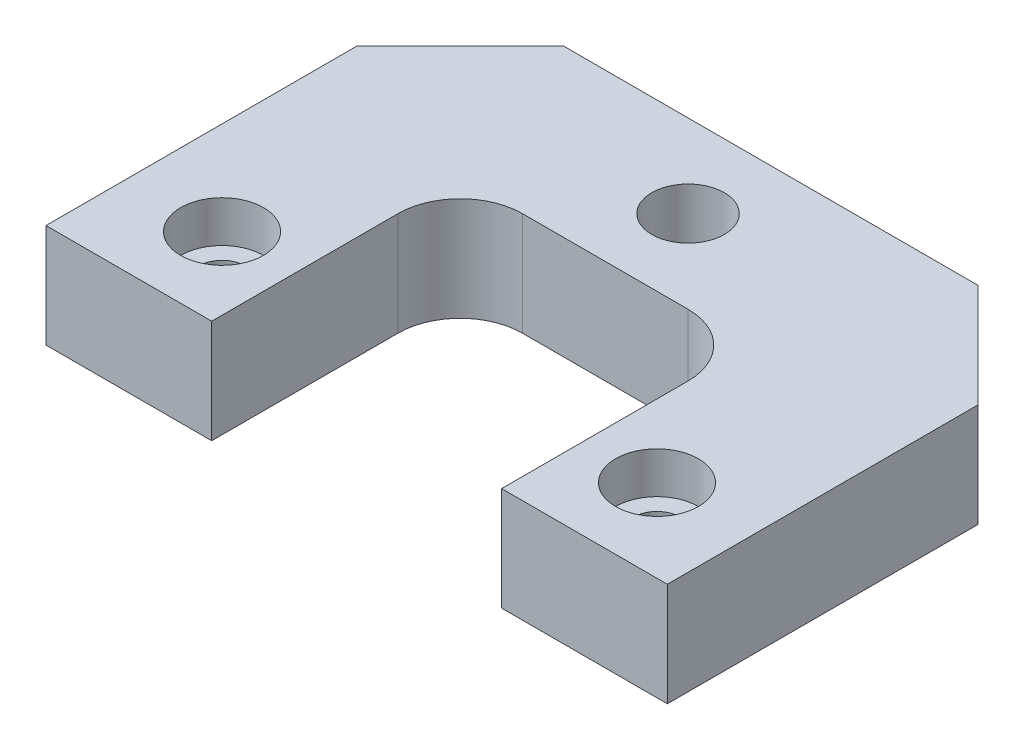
ISO-10303-21;
HEADER;
FILE_DESCRIPTION(('STEP AP214'),'2;1');
FILE_NAME('part.step','',(''),(''),'','','');
FILE_SCHEMA(('AUTOMOTIVE_DESIGN { 1 0 10303 214 1 1 1 1 }'));
ENDSEC;
DATA;
#1=APPLICATION_CONTEXT('core data for automotive mechanical design processes');
#2=APPLICATION_PROTOCOL_DEFINITION('international standard','automotive_design',2000,#1);
#3=PRODUCT_CONTEXT('',#1,'mechanical');
#4=PRODUCT('Part','Part','',(#3));
#5=PRODUCT_RELATED_PRODUCT_CATEGORY('part','',(#4));
#6=PRODUCT_DEFINITION_FORMATION('','',#4);
#7=PRODUCT_DEFINITION_CONTEXT('part definition',#1,'design');
#8=PRODUCT_DEFINITION('design','',#6,#7);
#9=PRODUCT_DEFINITION_SHAPE('','',#8);
#10=(LENGTH_UNIT() NAMED_UNIT(*) SI_UNIT(.MILLI.,.METRE.));
#11=(NAMED_UNIT(*) PLANE_ANGLE_UNIT() SI_UNIT($,.RADIAN.));
#12=(NAMED_UNIT(*) SI_UNIT($,.STERADIAN.) SOLID_ANGLE_UNIT());
#13=UNCERTAINTY_MEASURE_WITH_UNIT(LENGTH_MEASURE(1.E-05),#10,'distance_accuracy_value','');
#14=(GEOMETRIC_REPRESENTATION_CONTEXT(3) GLOBAL_UNCERTAINTY_ASSIGNED_CONTEXT((#13)) GLOBAL_UNIT_ASSIGNED_CONTEXT((#10,
#11,#12)) REPRESENTATION_CONTEXT('',''));
#15=CARTESIAN_POINT('',(0.,0.,0.));
#16=DIRECTION('',(0.,0.,1.));
#17=DIRECTION('',(1.,0.,0.));
#18=AXIS2_PLACEMENT_3D('',#15,#16,#17);
#19=CARTESIAN_POINT('',(21.,6.,12.));
#20=DIRECTION('',(0.,1.,0.));
#21=DIRECTION('',(0.,0.,1.));
#22=AXIS2_PLACEMENT_3D('',#19,#20,#21);
#23=CYLINDRICAL_SURFACE('',#22,4.);
#24=CARTESIAN_POINT('',(21.,10.,12.));
#25=DIRECTION('',(0.,1.,0.));
#26=DIRECTION('',(0.,0.,1.));
#27=AXIS2_PLACEMENT_3D('',#24,#25,#26);
#28=CIRCLE('',#27,4.);
#29=CARTESIAN_POINT('',(21.,10.,16.));
#30=VERTEX_POINT('',#29);
#31=EDGE_CURVE('E232',#30,#30,#28,.F.);
#32=ORIENTED_EDGE('',*,*,#31,.F.);
#33=EDGE_LOOP('',(#32));
#34=FACE_BOUND('',#33,.T.);
#35=CARTESIAN_POINT('',(21.,6.,12.));
#36=DIRECTION('',(0.,1.,0.));
#37=DIRECTION('',(0.,0.,1.));
#38=AXIS2_PLACEMENT_3D('',#35,#36,#37);
#39=CIRCLE('',#38,4.);
#40=CARTESIAN_POINT('',(21.,6.,16.));
#41=VERTEX_POINT('',#40);
#42=EDGE_CURVE('E20',#41,#41,#39,.T.);
#43=ORIENTED_EDGE('',*,*,#42,.F.);
#44=EDGE_LOOP('',(#43));
#45=FACE_BOUND('',#44,.T.);
#46=ADVANCED_FACE('F17',(#34,#45),#23,.F.);
#47=CARTESIAN_POINT('',(-21.,6.,12.));
#48=DIRECTION('',(0.,1.,0.));
#49=DIRECTION('',(0.,0.,1.));
#50=AXIS2_PLACEMENT_3D('',#47,#48,#49);
#51=CYLINDRICAL_SURFACE('',#50,4.);
#52=CARTESIAN_POINT('',(-21.,10.,12.));
#53=DIRECTION('',(0.,1.,0.));
#54=DIRECTION('',(0.,0.,1.));
#55=AXIS2_PLACEMENT_3D('',#52,#53,#54);
#56=CIRCLE('',#55,4.);
#57=CARTESIAN_POINT('',(-21.,10.,16.));
#58=VERTEX_POINT('',#57);
#59=EDGE_CURVE('E229',#58,#58,#56,.F.);
#60=ORIENTED_EDGE('',*,*,#59,.F.);
#61=EDGE_LOOP('',(#60));
#62=FACE_BOUND('',#61,.T.);
#63=CARTESIAN_POINT('',(-21.,6.,12.));
#64=DIRECTION('',(0.,1.,0.));
#65=DIRECTION('',(0.,0.,1.));
#66=AXIS2_PLACEMENT_3D('',#63,#64,#65);
#67=CIRCLE('',#66,4.);
#68=CARTESIAN_POINT('',(-21.,6.,16.));
#69=VERTEX_POINT('',#68);
#70=EDGE_CURVE('E234',#69,#69,#67,.T.);
#71=ORIENTED_EDGE('',*,*,#70,.F.);
#72=EDGE_LOOP('',(#71));
#73=FACE_BOUND('',#72,.T.);
#74=ADVANCED_FACE('F244',(#62,#73),#51,.F.);
#75=CARTESIAN_POINT('',(21.,6.,12.));
#76=DIRECTION('',(0.,1.,0.));
#77=DIRECTION('',(0.,0.,1.));
#78=AXIS2_PLACEMENT_3D('',#75,#76,#77);
#79=PLANE('',#78);
#80=CARTESIAN_POINT('',(21.,6.,12.));
#81=DIRECTION('',(0.,1.,0.));
#82=DIRECTION('',(0.,0.,1.));
#83=AXIS2_PLACEMENT_3D('',#80,#81,#82);
#84=CIRCLE('',#83,2.25);
#85=CARTESIAN_POINT('',(21.,6.,14.25));
#86=VERTEX_POINT('',#85);
#87=EDGE_CURVE('E223',#86,#86,#84,.F.);
#88=ORIENTED_EDGE('',*,*,#87,.T.);
#89=EDGE_LOOP('',(#88));
#90=FACE_BOUND('',#89,.T.);
#91=ORIENTED_EDGE('',*,*,#42,.T.);
#92=EDGE_LOOP('',(#91));
#93=FACE_BOUND('',#92,.T.);
#94=ADVANCED_FACE('F241',(#90,#93),#79,.T.);
#95=CARTESIAN_POINT('',(-21.,6.,12.));
#96=DIRECTION('',(0.,1.,0.));
#97=DIRECTION('',(0.,0.,1.));
#98=AXIS2_PLACEMENT_3D('',#95,#96,#97);
#99=PLANE('',#98);
#100=CARTESIAN_POINT('',(-21.,6.,12.));
#101=DIRECTION('',(0.,1.,0.));
#102=DIRECTION('',(0.,0.,1.));
#103=AXIS2_PLACEMENT_3D('',#100,#101,#102);
#104=CIRCLE('',#103,2.25);
#105=CARTESIAN_POINT('',(-21.,6.,14.25));
#106=VERTEX_POINT('',#105);
#107=EDGE_CURVE('E177',#106,#106,#104,.F.);
#108=ORIENTED_EDGE('',*,*,#107,.T.);
#109=EDGE_LOOP('',(#108));
#110=FACE_BOUND('',#109,.T.);
#111=ORIENTED_EDGE('',*,*,#70,.T.);
#112=EDGE_LOOP('',(#111));
#113=FACE_BOUND('',#112,.T.);
#114=ADVANCED_FACE('F318',(#110,#113),#99,.T.);
#115=CARTESIAN_POINT('',(0.,10.,0.));
#116=DIRECTION('',(0.,1.,0.));
#117=DIRECTION('',(0.,0.,1.));
#118=AXIS2_PLACEMENT_3D('',#115,#116,#117);
#119=PLANE('',#118);
#120=DIRECTION('',(0.,0.,-1.));
#121=VECTOR('',#120,1.);
#122=CARTESIAN_POINT('',(14.,10.,44.));
#123=LINE('',#122,#121);
#124=CARTESIAN_POINT('',(14.,10.,2.00000000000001));
#125=VERTEX_POINT('',#124);
#126=CARTESIAN_POINT('',(14.,10.,20.));
#127=VERTEX_POINT('',#126);
#128=EDGE_CURVE('E186',#125,#127,#123,.F.);
#129=ORIENTED_EDGE('',*,*,#128,.T.);
#130=DIRECTION('',(-1.,0.,0.));
#131=VECTOR('',#130,1.);
#132=CARTESIAN_POINT('',(-30.,10.,20.));
#133=LINE('',#132,#131);
#134=CARTESIAN_POINT('',(30.,10.,20.));
#135=VERTEX_POINT('',#134);
#136=EDGE_CURVE('E192',#127,#135,#133,.F.);
#137=ORIENTED_EDGE('',*,*,#136,.T.);
#138=DIRECTION('',(0.,0.,1.));
#139=VECTOR('',#138,1.);
#140=CARTESIAN_POINT('',(30.,10.,-20.));
#141=LINE('',#140,#139);
#142=CARTESIAN_POINT('',(30.,10.,-9.99999999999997));
#143=VERTEX_POINT('',#142);
#144=EDGE_CURVE('E519',#135,#143,#141,.F.);
#145=ORIENTED_EDGE('',*,*,#144,.T.);
#146=DIRECTION('',(0.707106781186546,0.,0.707106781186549));
#147=VECTOR('',#146,1.);
#148=CARTESIAN_POINT('',(20.,10.,-20.));
#149=LINE('',#148,#147);
#150=CARTESIAN_POINT('',(20.,10.,-20.));
#151=VERTEX_POINT('',#150);
#152=EDGE_CURVE('E171',#143,#151,#149,.F.);
#153=ORIENTED_EDGE('',*,*,#152,.T.);
#154=DIRECTION('',(1.,0.,0.));
#155=VECTOR('',#154,1.);
#156=CARTESIAN_POINT('',(-30.,10.,-20.));
#157=LINE('',#156,#155);
#158=CARTESIAN_POINT('',(-19.9999999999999,10.,-20.));
#159=VERTEX_POINT('',#158);
#160=EDGE_CURVE('E180',#151,#159,#157,.F.);
#161=ORIENTED_EDGE('',*,*,#160,.T.);
#162=DIRECTION('',(0.707106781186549,0.,-0.707106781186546));
#163=VECTOR('',#162,1.);
#164=CARTESIAN_POINT('',(-30.,10.,-9.99999999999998));
#165=LINE('',#164,#163);
#166=CARTESIAN_POINT('',(-30.,10.,-9.99999999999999));
#167=VERTEX_POINT('',#166);
#168=EDGE_CURVE('E160',#159,#167,#165,.F.);
#169=ORIENTED_EDGE('',*,*,#168,.T.);
#170=DIRECTION('',(0.,0.,-1.));
#171=VECTOR('',#170,1.);
#172=CARTESIAN_POINT('',(-30.,10.,-20.));
#173=LINE('',#172,#171);
#174=CARTESIAN_POINT('',(-30.,10.,20.));
#175=VERTEX_POINT('',#174);
#176=EDGE_CURVE('E149',#167,#175,#173,.F.);
#177=ORIENTED_EDGE('',*,*,#176,.T.);
#178=DIRECTION('',(-1.,0.,0.));
#179=VECTOR('',#178,1.);
#180=CARTESIAN_POINT('',(-30.,10.,20.));
#181=LINE('',#180,#179);
#182=CARTESIAN_POINT('',(-14.,10.,20.));
#183=VERTEX_POINT('',#182);
#184=EDGE_CURVE('E136',#175,#183,#181,.F.);
#185=ORIENTED_EDGE('',*,*,#184,.T.);
#186=DIRECTION('',(0.,0.,1.));
#187=VECTOR('',#186,1.);
#188=CARTESIAN_POINT('',(-14.,10.,44.));
#189=LINE('',#188,#187);
#190=CARTESIAN_POINT('',(-14.,10.,2.00000000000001));
#191=VERTEX_POINT('',#190);
#192=EDGE_CURVE('E103',#183,#191,#189,.F.);
#193=ORIENTED_EDGE('',*,*,#192,.T.);
#194=CARTESIAN_POINT('',(-8.,10.,2.00000000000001));
#195=DIRECTION('',(0.,-1.,0.));
#196=DIRECTION('',(0.,0.,-1.));
#197=AXIS2_PLACEMENT_3D('',#194,#195,#196);
#198=CIRCLE('',#197,6.);
#199=CARTESIAN_POINT('',(-8.,10.,-3.99999999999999));
#200=VERTEX_POINT('',#199);
#201=EDGE_CURVE('E105',#191,#200,#198,.T.);
#202=ORIENTED_EDGE('',*,*,#201,.T.);
#203=DIRECTION('',(-1.,0.,0.));
#204=VECTOR('',#203,1.);
#205=CARTESIAN_POINT('',(-14.,10.,-3.99999999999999));
#206=LINE('',#205,#204);
#207=CARTESIAN_POINT('',(8.,10.,-3.99999999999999));
#208=VERTEX_POINT('',#207);
#209=EDGE_CURVE('E109',#200,#208,#206,.F.);
#210=ORIENTED_EDGE('',*,*,#209,.T.);
#211=CARTESIAN_POINT('',(8.,10.,2.00000000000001));
#212=DIRECTION('',(0.,-1.,0.));
#213=DIRECTION('',(0.,0.,-1.));
#214=AXIS2_PLACEMENT_3D('',#211,#212,#213);
#215=CIRCLE('',#214,6.);
#216=EDGE_CURVE('E219',#208,#125,#215,.T.);
#217=ORIENTED_EDGE('',*,*,#216,.T.);
#218=EDGE_LOOP('',(#129,#137,#145,#153,#161,#169,#177,#185,#193,#202,#210,#217));
#219=FACE_BOUND('',#218,.T.);
#220=ORIENTED_EDGE('',*,*,#59,.T.);
#221=EDGE_LOOP('',(#220));
#222=FACE_BOUND('',#221,.T.);
#223=ORIENTED_EDGE('',*,*,#31,.T.);
#224=EDGE_LOOP('',(#223));
#225=FACE_BOUND('',#224,.T.);
#226=CARTESIAN_POINT('',(0.,10.,-12.));
#227=DIRECTION('',(0.,1.,0.));
#228=DIRECTION('',(0.,0.,1.));
#229=AXIS2_PLACEMENT_3D('',#226,#227,#228);
#230=CIRCLE('',#229,3.5);
#231=CARTESIAN_POINT('',(0.,10.,-8.49999999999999));
#232=VERTEX_POINT('',#231);
#233=EDGE_CURVE('E226',#232,#232,#230,.F.);
#234=ORIENTED_EDGE('',*,*,#233,.T.);
#235=EDGE_LOOP('',(#234));
#236=FACE_BOUND('',#235,.T.);
#237=ADVANCED_FACE('F107',(#219,#222,#225,#236),#119,.T.);
#238=CARTESIAN_POINT('',(0.,10.,-12.));
#239=DIRECTION('',(0.,1.,0.));
#240=DIRECTION('',(0.,0.,1.));
#241=AXIS2_PLACEMENT_3D('',#238,#239,#240);
#242=CYLINDRICAL_SURFACE('',#241,3.5);
#243=CARTESIAN_POINT('',(0.,0.,-12.));
#244=DIRECTION('',(0.,1.,0.));
#245=DIRECTION('',(0.,0.,1.));
#246=AXIS2_PLACEMENT_3D('',#243,#244,#245);
#247=CIRCLE('',#246,3.5);
#248=CARTESIAN_POINT('',(0.,0.,-8.49999999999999));
#249=VERTEX_POINT('',#248);
#250=EDGE_CURVE('E183',#249,#249,#247,.F.);
#251=ORIENTED_EDGE('',*,*,#250,.T.);
#252=EDGE_LOOP('',(#251));
#253=FACE_BOUND('',#252,.T.);
#254=ORIENTED_EDGE('',*,*,#233,.F.);
#255=EDGE_LOOP('',(#254));
#256=FACE_BOUND('',#255,.T.);
#257=ADVANCED_FACE('F311',(#253,#256),#242,.F.);
#258=CARTESIAN_POINT('',(21.,0.,12.));
#259=DIRECTION('',(0.,1.,0.));
#260=DIRECTION('',(0.,0.,1.));
#261=AXIS2_PLACEMENT_3D('',#258,#259,#260);
#262=CYLINDRICAL_SURFACE('',#261,2.25);
#263=CARTESIAN_POINT('',(21.,0.,12.));
#264=DIRECTION('',(0.,1.,0.));
#265=DIRECTION('',(0.,0.,1.));
#266=AXIS2_PLACEMENT_3D('',#263,#264,#265);
#267=CIRCLE('',#266,2.25);
#268=CARTESIAN_POINT('',(21.,0.,14.25));
#269=VERTEX_POINT('',#268);
#270=EDGE_CURVE('E214',#269,#269,#267,.F.);
#271=ORIENTED_EDGE('',*,*,#270,.T.);
#272=EDGE_LOOP('',(#271));
#273=FACE_BOUND('',#272,.T.);
#274=ORIENTED_EDGE('',*,*,#87,.F.);
#275=EDGE_LOOP('',(#274));
#276=FACE_BOUND('',#275,.T.);
#277=ADVANCED_FACE('F307',(#273,#276),#262,.F.);
#278=CARTESIAN_POINT('',(-21.,0.,12.));
#279=DIRECTION('',(0.,1.,0.));
#280=DIRECTION('',(0.,0.,1.));
#281=AXIS2_PLACEMENT_3D('',#278,#279,#280);
#282=CYLINDRICAL_SURFACE('',#281,2.25);
#283=CARTESIAN_POINT('',(-21.,0.,12.));
#284=DIRECTION('',(0.,1.,0.));
#285=DIRECTION('',(0.,0.,1.));
#286=AXIS2_PLACEMENT_3D('',#283,#284,#285);
#287=CIRCLE('',#286,2.25);
#288=CARTESIAN_POINT('',(-21.,0.,14.25));
#289=VERTEX_POINT('',#288);
#290=EDGE_CURVE('E165',#289,#289,#287,.F.);
#291=ORIENTED_EDGE('',*,*,#290,.T.);
#292=EDGE_LOOP('',(#291));
#293=FACE_BOUND('',#292,.T.);
#294=ORIENTED_EDGE('',*,*,#107,.F.);
#295=EDGE_LOOP('',(#294));
#296=FACE_BOUND('',#295,.T.);
#297=ADVANCED_FACE('F303',(#293,#296),#282,.F.);
#298=CARTESIAN_POINT('',(-30.,10.,-9.99999999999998));
#299=DIRECTION('',(0.707106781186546,0.,0.707106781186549));
#300=DIRECTION('',(0.707106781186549,0.,-0.707106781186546));
#301=AXIS2_PLACEMENT_3D('',#298,#299,#300);
#302=PLANE('',#301);
#303=DIRECTION('',(0.,1.,0.));
#304=VECTOR('',#303,1.);
#305=CARTESIAN_POINT('',(-19.9999999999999,10.,-20.));
#306=LINE('',#305,#304);
#307=CARTESIAN_POINT('',(-19.9999999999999,0.,-20.));
#308=VERTEX_POINT('',#307);
#309=EDGE_CURVE('E168',#159,#308,#306,.F.);
#310=ORIENTED_EDGE('',*,*,#309,.T.);
#311=DIRECTION('',(-0.707106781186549,0.,0.707106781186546));
#312=VECTOR('',#311,1.);
#313=CARTESIAN_POINT('',(-19.9999999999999,0.,-20.));
#314=LINE('',#313,#312);
#315=CARTESIAN_POINT('',(-30.,0.,-9.99999999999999));
#316=VERTEX_POINT('',#315);
#317=EDGE_CURVE('E154',#308,#316,#314,.T.);
#318=ORIENTED_EDGE('',*,*,#317,.T.);
#319=DIRECTION('',(0.,1.,0.));
#320=VECTOR('',#319,1.);
#321=CARTESIAN_POINT('',(-30.,10.,-9.99999999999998));
#322=LINE('',#321,#320);
#323=EDGE_CURVE('E157',#316,#167,#322,.T.);
#324=ORIENTED_EDGE('',*,*,#323,.T.);
#325=ORIENTED_EDGE('',*,*,#168,.F.);
#326=EDGE_LOOP('',(#310,#318,#324,#325));
#327=FACE_BOUND('',#326,.T.);
#328=ADVANCED_FACE('F299',(#327),#302,.F.);
#329=CARTESIAN_POINT('',(-30.,10.,-20.));
#330=DIRECTION('',(1.,0.,0.));
#331=DIRECTION('',(0.,0.,-1.));
#332=AXIS2_PLACEMENT_3D('',#329,#330,#331);
#333=PLANE('',#332);
#334=ORIENTED_EDGE('',*,*,#323,.F.);
#335=DIRECTION('',(0.,0.,1.));
#336=VECTOR('',#335,1.);
#337=CARTESIAN_POINT('',(-30.,0.,0.));
#338=LINE('',#337,#336);
#339=CARTESIAN_POINT('',(-30.,0.,20.));
#340=VERTEX_POINT('',#339);
#341=EDGE_CURVE('E143',#316,#340,#338,.T.);
#342=ORIENTED_EDGE('',*,*,#341,.T.);
#343=DIRECTION('',(0.,1.,0.));
#344=VECTOR('',#343,1.);
#345=CARTESIAN_POINT('',(-30.,10.,20.));
#346=LINE('',#345,#344);
#347=EDGE_CURVE('E146',#340,#175,#346,.T.);
#348=ORIENTED_EDGE('',*,*,#347,.T.);
#349=ORIENTED_EDGE('',*,*,#176,.F.);
#350=EDGE_LOOP('',(#334,#342,#348,#349));
#351=FACE_BOUND('',#350,.T.);
#352=ADVANCED_FACE('F295',(#351),#333,.F.);
#353=CARTESIAN_POINT('',(-30.,10.,20.));
#354=DIRECTION('',(0.,0.,-1.));
#355=DIRECTION('',(-1.,0.,0.));
#356=AXIS2_PLACEMENT_3D('',#353,#354,#355);
#357=PLANE('',#356);
#358=DIRECTION('',(0.,1.,0.));
#359=VECTOR('',#358,1.);
#360=CARTESIAN_POINT('',(-14.,0.,20.));
#361=LINE('',#360,#359);
#362=CARTESIAN_POINT('',(-14.,0.,20.));
#363=VERTEX_POINT('',#362);
#364=EDGE_CURVE('E133',#363,#183,#361,.T.);
#365=ORIENTED_EDGE('',*,*,#364,.T.);
#366=ORIENTED_EDGE('',*,*,#184,.F.);
#367=ORIENTED_EDGE('',*,*,#347,.F.);
#368=DIRECTION('',(1.,0.,0.));
#369=VECTOR('',#368,1.);
#370=CARTESIAN_POINT('',(0.,0.,20.));
#371=LINE('',#370,#369);
#372=EDGE_CURVE('E139',#340,#363,#371,.T.);
#373=ORIENTED_EDGE('',*,*,#372,.T.);
#374=EDGE_LOOP('',(#365,#366,#367,#373));
#375=FACE_BOUND('',#374,.T.);
#376=ADVANCED_FACE('F291',(#375),#357,.F.);
#377=CARTESIAN_POINT('',(-14.,0.,44.));
#378=DIRECTION('',(-1.,0.,0.));
#379=DIRECTION('',(0.,0.,1.));
#380=AXIS2_PLACEMENT_3D('',#377,#378,#379);
#381=PLANE('',#380);
#382=DIRECTION('',(0.,-1.,0.));
#383=VECTOR('',#382,1.);
#384=CARTESIAN_POINT('',(-14.,0.,2.00000000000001));
#385=LINE('',#384,#383);
#386=CARTESIAN_POINT('',(-14.,0.,2.00000000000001));
#387=VERTEX_POINT('',#386);
#388=EDGE_CURVE('E115',#387,#191,#385,.F.);
#389=ORIENTED_EDGE('',*,*,#388,.T.);
#390=ORIENTED_EDGE('',*,*,#192,.F.);
#391=ORIENTED_EDGE('',*,*,#364,.F.);
#392=DIRECTION('',(0.,0.,1.));
#393=VECTOR('',#392,1.);
#394=CARTESIAN_POINT('',(-14.,0.,0.));
#395=LINE('',#394,#393);
#396=EDGE_CURVE('E142',#363,#387,#395,.F.);
#397=ORIENTED_EDGE('',*,*,#396,.T.);
#398=EDGE_LOOP('',(#389,#390,#391,#397));
#399=FACE_BOUND('',#398,.T.);
#400=ADVANCED_FACE('F288',(#399),#381,.F.);
#401=CARTESIAN_POINT('',(-8.,0.,2.00000000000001));
#402=DIRECTION('',(0.,-1.,0.));
#403=DIRECTION('',(0.,0.,-1.));
#404=AXIS2_PLACEMENT_3D('',#401,#402,#403);
#405=CYLINDRICAL_SURFACE('',#404,6.);
#406=DIRECTION('',(0.,1.,0.));
#407=VECTOR('',#406,1.);
#408=CARTESIAN_POINT('',(-8.,0.,-3.99999999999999));
#409=LINE('',#408,#407);
#410=CARTESIAN_POINT('',(-8.,0.,-3.99999999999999));
#411=VERTEX_POINT('',#410);
#412=EDGE_CURVE('E114',#411,#200,#409,.T.);
#413=ORIENTED_EDGE('',*,*,#412,.T.);
#414=ORIENTED_EDGE('',*,*,#201,.F.);
#415=ORIENTED_EDGE('',*,*,#388,.F.);
#416=CARTESIAN_POINT('',(-8.,0.,2.00000000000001));
#417=DIRECTION('',(0.,-1.,0.));
#418=DIRECTION('',(0.,0.,-1.));
#419=AXIS2_PLACEMENT_3D('',#416,#417,#418);
#420=CIRCLE('',#419,6.);
#421=EDGE_CURVE('E127',#387,#411,#420,.T.);
#422=ORIENTED_EDGE('',*,*,#421,.T.);
#423=EDGE_LOOP('',(#413,#414,#415,#422));
#424=FACE_BOUND('',#423,.T.);
#425=ADVANCED_FACE('F125',(#424),#405,.F.);
#426=CARTESIAN_POINT('',(-14.,0.,-3.99999999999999));
#427=DIRECTION('',(0.,0.,-1.));
#428=DIRECTION('',(-1.,0.,0.));
#429=AXIS2_PLACEMENT_3D('',#426,#427,#428);
#430=PLANE('',#429);
#431=DIRECTION('',(0.,-1.,0.));
#432=VECTOR('',#431,1.);
#433=CARTESIAN_POINT('',(8.,0.,-3.99999999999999));
#434=LINE('',#433,#432);
#435=CARTESIAN_POINT('',(8.,0.,-3.99999999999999));
#436=VERTEX_POINT('',#435);
#437=EDGE_CURVE('E122',#436,#208,#434,.F.);
#438=ORIENTED_EDGE('',*,*,#437,.T.);
#439=ORIENTED_EDGE('',*,*,#209,.F.);
#440=ORIENTED_EDGE('',*,*,#412,.F.);
#441=DIRECTION('',(1.,0.,0.));
#442=VECTOR('',#441,1.);
#443=CARTESIAN_POINT('',(0.,0.,-3.99999999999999));
#444=LINE('',#443,#442);
#445=EDGE_CURVE('E210',#411,#436,#444,.T.);
#446=ORIENTED_EDGE('',*,*,#445,.T.);
#447=EDGE_LOOP('',(#438,#439,#440,#446));
#448=FACE_BOUND('',#447,.T.);
#449=ADVANCED_FACE('F119',(#448),#430,.F.);
#450=CARTESIAN_POINT('',(8.,0.,2.00000000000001));
#451=DIRECTION('',(0.,-1.,0.));
#452=DIRECTION('',(0.,0.,-1.));
#453=AXIS2_PLACEMENT_3D('',#450,#451,#452);
#454=CYLINDRICAL_SURFACE('',#453,6.);
#455=DIRECTION('',(0.,1.,0.));
#456=VECTOR('',#455,1.);
#457=CARTESIAN_POINT('',(14.,0.,2.00000000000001));
#458=LINE('',#457,#456);
#459=CARTESIAN_POINT('',(14.,0.,2.00000000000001));
#460=VERTEX_POINT('',#459);
#461=EDGE_CURVE('E189',#460,#125,#458,.T.);
#462=ORIENTED_EDGE('',*,*,#461,.T.);
#463=ORIENTED_EDGE('',*,*,#216,.F.);
#464=ORIENTED_EDGE('',*,*,#437,.F.);
#465=CARTESIAN_POINT('',(8.,0.,2.00000000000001));
#466=DIRECTION('',(0.,-1.,0.));
#467=DIRECTION('',(0.,0.,-1.));
#468=AXIS2_PLACEMENT_3D('',#465,#466,#467);
#469=CIRCLE('',#468,6.);
#470=EDGE_CURVE('E206',#436,#460,#469,.T.);
#471=ORIENTED_EDGE('',*,*,#470,.T.);
#472=EDGE_LOOP('',(#462,#463,#464,#471));
#473=FACE_BOUND('',#472,.T.);
#474=ADVANCED_FACE('F279',(#473),#454,.F.);
#475=CARTESIAN_POINT('',(14.,0.,44.));
#476=DIRECTION('',(1.,0.,0.));
#477=DIRECTION('',(0.,0.,-1.));
#478=AXIS2_PLACEMENT_3D('',#475,#476,#477);
#479=PLANE('',#478);
#480=ORIENTED_EDGE('',*,*,#461,.F.);
#481=DIRECTION('',(0.,0.,1.));
#482=VECTOR('',#481,1.);
#483=CARTESIAN_POINT('',(14.,0.,0.));
#484=LINE('',#483,#482);
#485=CARTESIAN_POINT('',(14.,0.,20.));
#486=VERTEX_POINT('',#485);
#487=EDGE_CURVE('E209',#460,#486,#484,.T.);
#488=ORIENTED_EDGE('',*,*,#487,.T.);
#489=DIRECTION('',(0.,1.,0.));
#490=VECTOR('',#489,1.);
#491=CARTESIAN_POINT('',(14.,10.,20.));
#492=LINE('',#491,#490);
#493=EDGE_CURVE('E188',#486,#127,#492,.T.);
#494=ORIENTED_EDGE('',*,*,#493,.T.);
#495=ORIENTED_EDGE('',*,*,#128,.F.);
#496=EDGE_LOOP('',(#480,#488,#494,#495));
#497=FACE_BOUND('',#496,.T.);
#498=ADVANCED_FACE('F275',(#497),#479,.F.);
#499=CARTESIAN_POINT('',(-30.,10.,20.));
#500=DIRECTION('',(0.,0.,-1.));
#501=DIRECTION('',(-1.,0.,0.));
#502=AXIS2_PLACEMENT_3D('',#499,#500,#501);
#503=PLANE('',#502);
#504=ORIENTED_EDGE('',*,*,#493,.F.);
#505=DIRECTION('',(1.,0.,0.));
#506=VECTOR('',#505,1.);
#507=CARTESIAN_POINT('',(0.,0.,20.));
#508=LINE('',#507,#506);
#509=CARTESIAN_POINT('',(30.,0.,20.));
#510=VERTEX_POINT('',#509);
#511=EDGE_CURVE('E504',#486,#510,#508,.T.);
#512=ORIENTED_EDGE('',*,*,#511,.T.);
#513=DIRECTION('',(0.,1.,0.));
#514=VECTOR('',#513,1.);
#515=CARTESIAN_POINT('',(30.,10.,20.));
#516=LINE('',#515,#514);
#517=EDGE_CURVE('E194',#510,#135,#516,.T.);
#518=ORIENTED_EDGE('',*,*,#517,.T.);
#519=ORIENTED_EDGE('',*,*,#136,.F.);
#520=EDGE_LOOP('',(#504,#512,#518,#519));
#521=FACE_BOUND('',#520,.T.);
#522=ADVANCED_FACE('F271',(#521),#503,.F.);
#523=CARTESIAN_POINT('',(30.,10.,-20.));
#524=DIRECTION('',(-1.,0.,0.));
#525=DIRECTION('',(0.,0.,1.));
#526=AXIS2_PLACEMENT_3D('',#523,#524,#525);
#527=PLANE('',#526);
#528=DIRECTION('',(0.,1.,0.));
#529=VECTOR('',#528,1.);
#530=CARTESIAN_POINT('',(30.,10.,-9.99999999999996));
#531=LINE('',#530,#529);
#532=CARTESIAN_POINT('',(30.,0.,-9.99999999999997));
#533=VERTEX_POINT('',#532);
#534=EDGE_CURVE('E501',#533,#143,#531,.T.);
#535=ORIENTED_EDGE('',*,*,#534,.T.);
#536=ORIENTED_EDGE('',*,*,#144,.F.);
#537=ORIENTED_EDGE('',*,*,#517,.F.);
#538=DIRECTION('',(0.,0.,1.));
#539=VECTOR('',#538,1.);
#540=CARTESIAN_POINT('',(30.,0.,0.));
#541=LINE('',#540,#539);
#542=EDGE_CURVE('E502',#510,#533,#541,.F.);
#543=ORIENTED_EDGE('',*,*,#542,.T.);
#544=EDGE_LOOP('',(#535,#536,#537,#543));
#545=FACE_BOUND('',#544,.T.);
#546=ADVANCED_FACE('F267',(#545),#527,.F.);
#547=CARTESIAN_POINT('',(20.,10.,-20.));
#548=DIRECTION('',(-0.707106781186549,0.,0.707106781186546));
#549=DIRECTION('',(0.707106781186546,0.,0.707106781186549));
#550=AXIS2_PLACEMENT_3D('',#547,#548,#549);
#551=PLANE('',#550);
#552=ORIENTED_EDGE('',*,*,#534,.F.);
#553=DIRECTION('',(-0.707106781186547,0.,-0.707106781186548));
#554=VECTOR('',#553,1.);
#555=CARTESIAN_POINT('',(30.,0.,-9.99999999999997));
#556=LINE('',#555,#554);
#557=CARTESIAN_POINT('',(20.,0.,-20.));
#558=VERTEX_POINT('',#557);
#559=EDGE_CURVE('E26',#533,#558,#556,.T.);
#560=ORIENTED_EDGE('',*,*,#559,.T.);
#561=DIRECTION('',(0.,1.,0.));
#562=VECTOR('',#561,1.);
#563=CARTESIAN_POINT('',(20.,10.,-20.));
#564=LINE('',#563,#562);
#565=EDGE_CURVE('E34',#558,#151,#564,.T.);
#566=ORIENTED_EDGE('',*,*,#565,.T.);
#567=ORIENTED_EDGE('',*,*,#152,.F.);
#568=EDGE_LOOP('',(#552,#560,#566,#567));
#569=FACE_BOUND('',#568,.T.);
#570=ADVANCED_FACE('F260',(#569),#551,.F.);
#571=CARTESIAN_POINT('',(-30.,10.,-20.));
#572=DIRECTION('',(0.,0.,1.));
#573=DIRECTION('',(1.,0.,0.));
#574=AXIS2_PLACEMENT_3D('',#571,#572,#573);
#575=PLANE('',#574);
#576=ORIENTED_EDGE('',*,*,#565,.F.);
#577=DIRECTION('',(1.,0.,0.));
#578=VECTOR('',#577,1.);
#579=CARTESIAN_POINT('',(0.,0.,-20.));
#580=LINE('',#579,#578);
#581=EDGE_CURVE('E11',#558,#308,#580,.F.);
#582=ORIENTED_EDGE('',*,*,#581,.T.);
#583=ORIENTED_EDGE('',*,*,#309,.F.);
#584=ORIENTED_EDGE('',*,*,#160,.F.);
#585=EDGE_LOOP('',(#576,#582,#583,#584));
#586=FACE_BOUND('',#585,.T.);
#587=ADVANCED_FACE('F254',(#586),#575,.F.);
#588=CARTESIAN_POINT('',(0.,0.,0.));
#589=DIRECTION('',(0.,1.,0.));
#590=DIRECTION('',(0.,0.,1.));
#591=AXIS2_PLACEMENT_3D('',#588,#589,#590);
#592=PLANE('',#591);
#593=ORIENTED_EDGE('',*,*,#559,.F.);
#594=ORIENTED_EDGE('',*,*,#542,.F.);
#595=ORIENTED_EDGE('',*,*,#511,.F.);
#596=ORIENTED_EDGE('',*,*,#487,.F.);
#597=ORIENTED_EDGE('',*,*,#470,.F.);
#598=ORIENTED_EDGE('',*,*,#445,.F.);
#599=ORIENTED_EDGE('',*,*,#421,.F.);
#600=ORIENTED_EDGE('',*,*,#396,.F.);
#601=ORIENTED_EDGE('',*,*,#372,.F.);
#602=ORIENTED_EDGE('',*,*,#341,.F.);
#603=ORIENTED_EDGE('',*,*,#317,.F.);
#604=ORIENTED_EDGE('',*,*,#581,.F.);
#605=EDGE_LOOP('',(#593,#594,#595,#596,#597,#598,#599,#600,#601,#602,#603,#604));
#606=FACE_BOUND('',#605,.T.);
#607=ORIENTED_EDGE('',*,*,#290,.F.);
#608=EDGE_LOOP('',(#607));
#609=FACE_BOUND('',#608,.T.);
#610=ORIENTED_EDGE('',*,*,#270,.F.);
#611=EDGE_LOOP('',(#610));
#612=FACE_BOUND('',#611,.T.);
#613=ORIENTED_EDGE('',*,*,#250,.F.);
#614=EDGE_LOOP('',(#613));
#615=FACE_BOUND('',#614,.T.);
#616=ADVANCED_FACE('F252',(#606,#609,#612,#615),#592,.F.);
#617=CLOSED_SHELL('',(#46,#74,#94,#114,#237,#257,#277,#297,#328,#352,#376,#400,#425,#449,#474,
#498,#522,#546,#570,#587,#616));
#618=MANIFOLD_SOLID_BREP('B1',#617);
#619=ADVANCED_BREP_SHAPE_REPRESENTATION('',(#18,#618),#14);
#620=SHAPE_DEFINITION_REPRESENTATION(#9,#619);
ENDSEC;
END-ISO-10303-21;
